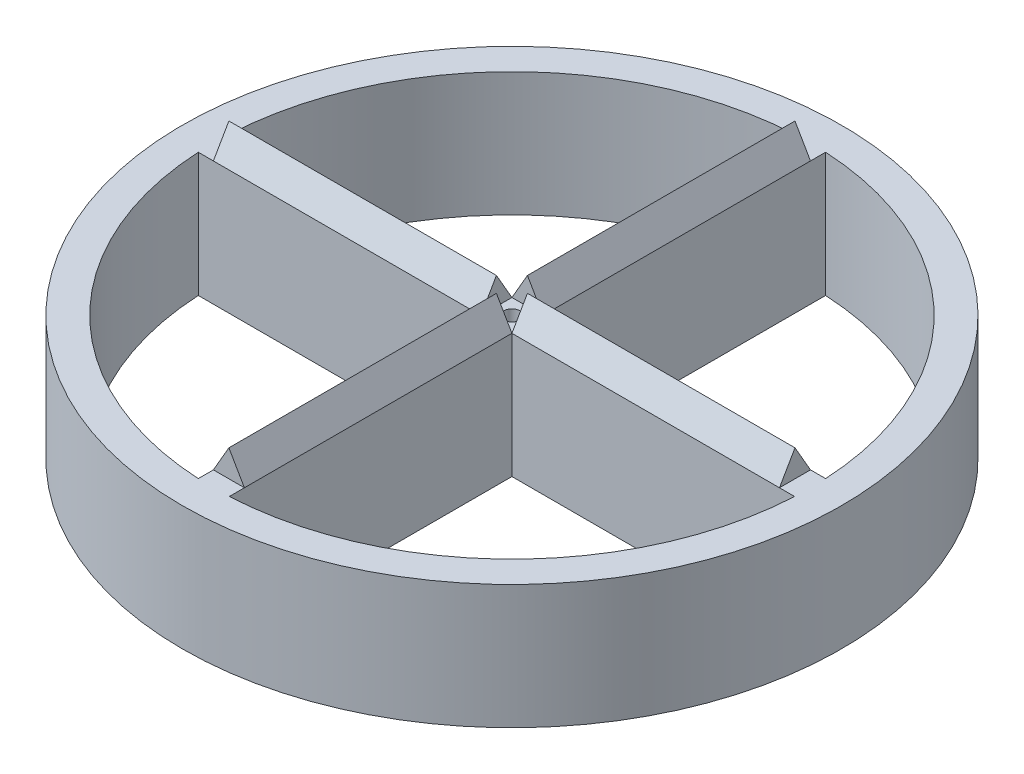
from build123d import *

# Parameters (mm, degrees)
SKETCH1_R                = 106.25
BOSS_EXTRUDE1_DEPTH      = 40
BOSS_EXTRUDE2_DEPTH      = 86.25
BOSS_EXTRUDE2_DEPTH_BACK = 96.25
CUT_EXTRUDE3_DEPTH       = 96.25
CUT_EXTRUDE3_DEPTH_BACK  = 96.25
SKETCH5_W                = 10
SKETCH5_H                = 17.660208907
BOSS_EXTRUDE3_DEPTH      = 86.25
BOSS_EXTRUDE3_DEPTH_BACK = 96.25
SKETCH7_W                = 10
SKETCH7_H                = 15.508918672
CUT_EXTRUDE4_DEPTH       = 10
SKETCH8_R                = 2.6
CUT_EXTRUDE5_DEPTH       = 110


with BuildPart() as part:
    # Sketch1 → Boss-Extrude1 (new body)
    with BuildSketch(Plane(origin=(0, 0, 0), x_dir=(1, 0, 0), z_dir=(0, 1, 0))):
        with Locations(Location((0, 0, 0), (0, 0, 270))):
            Circle(SKETCH1_R)
        with BuildLine():
            Line((-5, 5), (-5, 96.120042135))
            ThreePointArc((-5, 96.120042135), (-68.059027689, 68.059027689), (-96.120042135, 5))
            Line((-96.120042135, 5), (-5, 5))
        make_face(mode=Mode.SUBTRACT)
        with BuildLine():
            Line((5, 5), (5, 96.120042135))
            ThreePointArc((5, 96.120042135), (68.059027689, 68.059027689), (96.120042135, 5))
            Line((96.120042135, 5), (5, 5))
        make_face(mode=Mode.SUBTRACT)
        with BuildLine():
            Line((-5, -5), (-5, -96.120042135))
            ThreePointArc((-5, -96.120042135), (-68.059027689, -68.059027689), (-96.120042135, -5))
            Line((-96.120042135, -5), (-5, -5))
        make_face(mode=Mode.SUBTRACT)
        with BuildLine():
            Line((5, -5), (5, -96.120042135))
            ThreePointArc((5, -96.120042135), (68.059027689, -68.059027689), (96.120042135, -5))
            Line((96.120042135, -5), (5, -5))
        make_face(mode=Mode.SUBTRACT)
    extrude(amount=BOSS_EXTRUDE1_DEPTH)

    # Sketch2 → Boss-Extrude2 (add, two sides: drawn at the far end of the back side and taken through both)
    with BuildSketch(Plane.ZY.offset(5).offset(-BOSS_EXTRUDE2_DEPTH_BACK)):
        Polygon((-5, 40), (5, 40), (0, 48.660254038), align=None)
    extrude(amount=BOSS_EXTRUDE2_DEPTH + BOSS_EXTRUDE2_DEPTH_BACK)

    # Sketch5 → Cut-Extrude3 (cut, two sides: drawn at the far end of the back side and taken through both)
    with BuildSketch(Plane(origin=(0, 0, -5), x_dir=(-1, 0, 0), z_dir=(0, 0, -1)).offset(-CUT_EXTRUDE3_DEPTH_BACK)):
        with Locations((0, 48.830104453)):
            Rectangle(SKETCH5_W, SKETCH5_H)
    extrude(amount=CUT_EXTRUDE3_DEPTH + CUT_EXTRUDE3_DEPTH_BACK, mode=Mode.SUBTRACT)

    # Sketch6 → Boss-Extrude3 (add, two sides: drawn at the far end of the back side and taken through both)
    with BuildSketch(Plane(origin=(0, 0, -5), x_dir=(-1, 0, 0), z_dir=(0, 0, -1)).offset(-BOSS_EXTRUDE3_DEPTH_BACK)):
        Polygon((5, 40), (-5, 40), (0, 48.660254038), align=None)
    extrude(amount=BOSS_EXTRUDE3_DEPTH + BOSS_EXTRUDE3_DEPTH_BACK)

    # Sketch7 → Cut-Extrude4 (cut)
    with BuildSketch(Plane.ZY.offset(5)):
        with Locations((0, 47.754459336)):
            Rectangle(SKETCH7_W, SKETCH7_H)
    extrude(amount=-CUT_EXTRUDE4_DEPTH, mode=Mode.SUBTRACT)

    # Sketch8 → Cut-Extrude5 (cut)
    with BuildSketch(Plane(origin=(0, 40, 0), x_dir=(1, 0, 0), z_dir=(0, 1, 0))):
        with Locations(Location((0, 0, 0), (0, 0, 270))):
            Circle(SKETCH8_R)
    extrude(amount=-CUT_EXTRUDE5_DEPTH, mode=Mode.SUBTRACT)


solid = part.part
